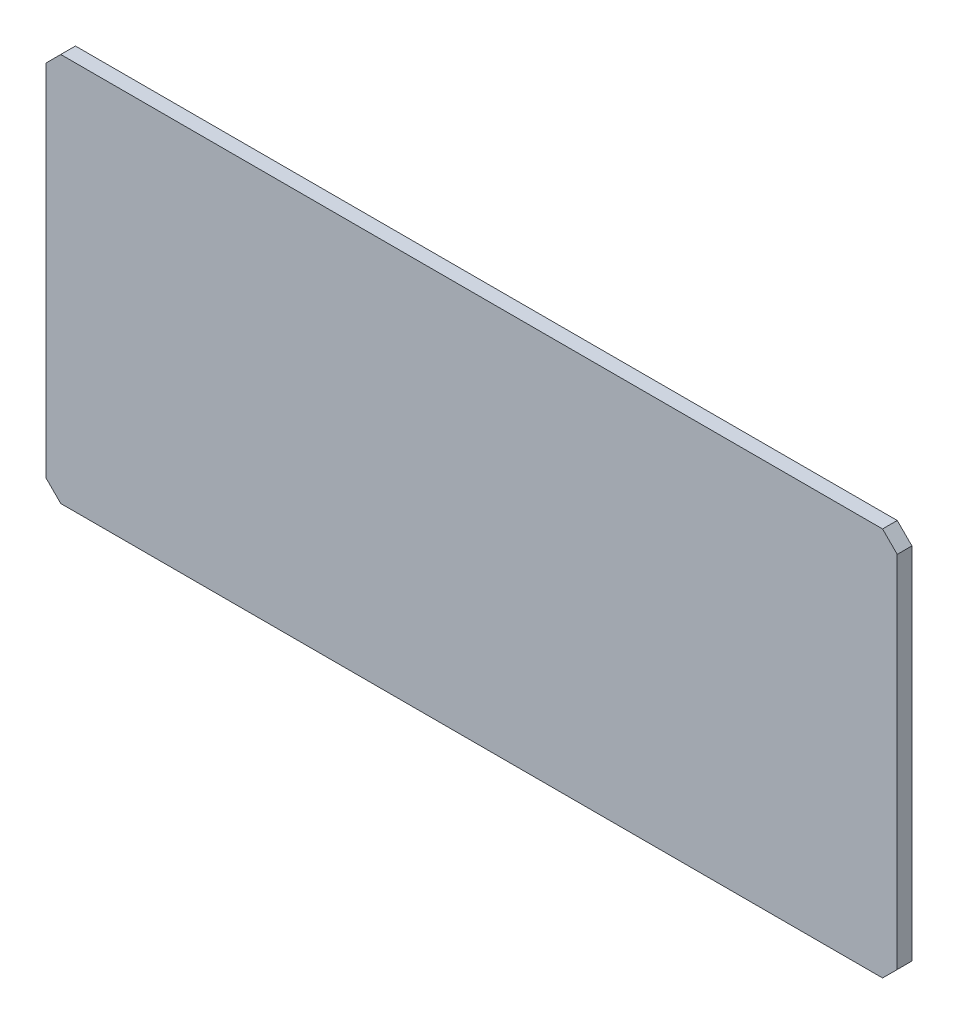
from build123d import *

# Parameters (mm, degrees)
ESQUISSE1_W      = 116
ESQUISSE1_H      = 53
EXTRUSION1_DEPTH = 2
CHANFREIN1_SIZE  = 2


with BuildPart() as part:
    # Esquisse1 → Extrusion1 (new body)
    with BuildSketch(Plane.XY):
        with Locations((-58, 26.5)):
            Rectangle(ESQUISSE1_W, ESQUISSE1_H)
    extrude(amount=EXTRUSION1_DEPTH)

    # Chanfrein1
    chanfrein1_edges = [part.edges().sort_by_distance(p)[0] for p in [
        (0, 0, 1),
        (-116, 0, 1),
        (-116, 53, 1),
        (0, 53, 1),
    ]]
    chamfer(chanfrein1_edges, length=CHANFREIN1_SIZE)


solid = part.part
